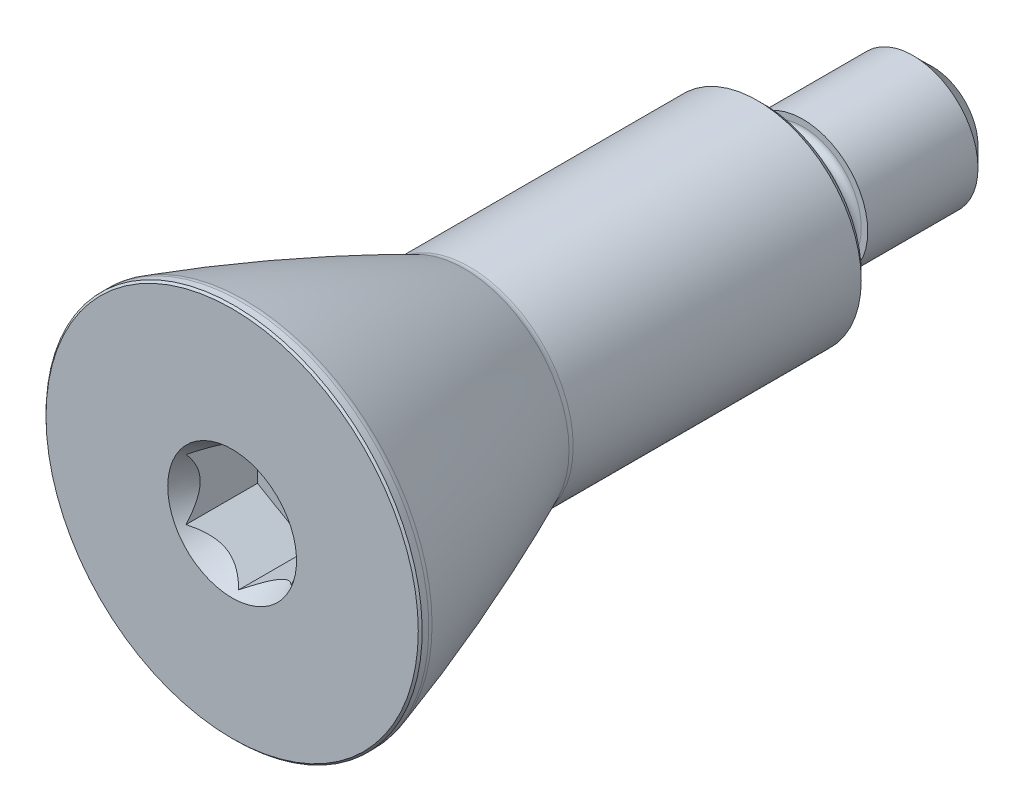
ISO-10303-21;
HEADER;
FILE_DESCRIPTION(('STEP AP214'),'2;1');
FILE_NAME('part.step','',(''),(''),'','','');
FILE_SCHEMA(('AUTOMOTIVE_DESIGN { 1 0 10303 214 1 1 1 1 }'));
ENDSEC;
DATA;
#1=APPLICATION_CONTEXT('core data for automotive mechanical design processes');
#2=APPLICATION_PROTOCOL_DEFINITION('international standard','automotive_design',2000,#1);
#3=PRODUCT_CONTEXT('',#1,'mechanical');
#4=PRODUCT('Part','Part','',(#3));
#5=PRODUCT_RELATED_PRODUCT_CATEGORY('part','',(#4));
#6=PRODUCT_DEFINITION_FORMATION('','',#4);
#7=PRODUCT_DEFINITION_CONTEXT('part definition',#1,'design');
#8=PRODUCT_DEFINITION('design','',#6,#7);
#9=PRODUCT_DEFINITION_SHAPE('','',#8);
#10=(LENGTH_UNIT() NAMED_UNIT(*) SI_UNIT(.MILLI.,.METRE.));
#11=(NAMED_UNIT(*) PLANE_ANGLE_UNIT() SI_UNIT($,.RADIAN.));
#12=(NAMED_UNIT(*) SI_UNIT($,.STERADIAN.) SOLID_ANGLE_UNIT());
#13=UNCERTAINTY_MEASURE_WITH_UNIT(LENGTH_MEASURE(1.E-05),#10,'distance_accuracy_value','');
#14=(GEOMETRIC_REPRESENTATION_CONTEXT(3) GLOBAL_UNCERTAINTY_ASSIGNED_CONTEXT((#13)) GLOBAL_UNIT_ASSIGNED_CONTEXT((#10,
#11,#12)) REPRESENTATION_CONTEXT('',''));
#15=CARTESIAN_POINT('',(0.,0.,0.));
#16=DIRECTION('',(0.,0.,1.));
#17=DIRECTION('',(1.,0.,0.));
#18=AXIS2_PLACEMENT_3D('',#15,#16,#17);
#19=CARTESIAN_POINT('',(0.,0.,41.));
#20=DIRECTION('',(0.,0.,-1.));
#21=DIRECTION('',(0.5,0.866025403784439,0.));
#22=AXIS2_PLACEMENT_3D('',#19,#20,#21);
#23=PLANE('',#22);
#24=CARTESIAN_POINT('',(0.,0.,41.));
#25=DIRECTION('',(0.,0.,-1.));
#26=DIRECTION('',(0.5,0.866025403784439,0.));
#27=AXIS2_PLACEMENT_3D('',#24,#25,#26);
#28=CIRCLE('',#27,14.35);
#29=CARTESIAN_POINT('',(7.175,12.4274645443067,41.));
#30=VERTEX_POINT('',#29);
#31=EDGE_CURVE('E22',#30,#30,#28,.F.);
#32=ORIENTED_EDGE('',*,*,#31,.T.);
#33=EDGE_LOOP('',(#32));
#34=FACE_BOUND('',#33,.T.);
#35=CARTESIAN_POINT('',(0.,0.,41.));
#36=DIRECTION('',(0.,0.,-1.));
#37=DIRECTION('',(0.5,0.866025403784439,0.));
#38=AXIS2_PLACEMENT_3D('',#35,#36,#37);
#39=CIRCLE('',#38,4.96521231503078);
#40=CARTESIAN_POINT('',(2.48260615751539,4.3,41.));
#41=VERTEX_POINT('',#40);
#42=EDGE_CURVE('E80',#41,#41,#39,.F.);
#43=ORIENTED_EDGE('',*,*,#42,.F.);
#44=EDGE_LOOP('',(#43));
#45=FACE_BOUND('',#44,.T.);
#46=ADVANCED_FACE('F14',(#34,#45),#23,.F.);
#47=CARTESIAN_POINT('',(0.,0.,-13.));
#48=DIRECTION('',(0.,0.,1.));
#49=DIRECTION('',(-0.5,-0.866025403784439,0.));
#50=AXIS2_PLACEMENT_3D('',#47,#48,#49);
#51=PLANE('',#50);
#52=CARTESIAN_POINT('',(0.,0.,-13.));
#53=DIRECTION('',(0.,0.,1.));
#54=DIRECTION('',(-0.5,-0.866025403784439,0.));
#55=AXIS2_PLACEMENT_3D('',#52,#53,#54);
#56=CIRCLE('',#55,3.5);
#57=CARTESIAN_POINT('',(-1.75,-3.03108891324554,-13.));
#58=VERTEX_POINT('',#57);
#59=EDGE_CURVE('E74',#58,#58,#56,.F.);
#60=ORIENTED_EDGE('',*,*,#59,.T.);
#61=EDGE_LOOP('',(#60));
#62=FACE_BOUND('',#61,.T.);
#63=ADVANCED_FACE('F204',(#62),#51,.F.);
#64=CARTESIAN_POINT('',(0.,0.,40.2674973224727));
#65=DIRECTION('',(0.,0.,1.));
#66=DIRECTION('',(-0.5,-0.866025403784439,0.));
#67=AXIS2_PLACEMENT_3D('',#64,#65,#66);
#68=CYLINDRICAL_SURFACE('',#67,5.);
#69=CARTESIAN_POINT('',(0.,0.,-11.5));
#70=DIRECTION('',(0.,0.,1.));
#71=DIRECTION('',(-0.5,-0.866025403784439,0.));
#72=AXIS2_PLACEMENT_3D('',#69,#70,#71);
#73=CIRCLE('',#72,5.);
#74=CARTESIAN_POINT('',(-2.5,-4.3301270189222,-11.5));
#75=VERTEX_POINT('',#74);
#76=EDGE_CURVE('E130',#75,#75,#73,.T.);
#77=ORIENTED_EDGE('',*,*,#76,.T.);
#78=EDGE_LOOP('',(#77));
#79=FACE_BOUND('',#78,.T.);
#80=CARTESIAN_POINT('',(0.,0.,-3.));
#81=DIRECTION('',(0.,0.,1.));
#82=DIRECTION('',(-0.5,-0.866025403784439,0.));
#83=AXIS2_PLACEMENT_3D('',#80,#81,#82);
#84=CIRCLE('',#83,5.);
#85=CARTESIAN_POINT('',(-2.5,-4.3301270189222,-3.));
#86=VERTEX_POINT('',#85);
#87=EDGE_CURVE('E121',#86,#86,#84,.T.);
#88=ORIENTED_EDGE('',*,*,#87,.F.);
#89=EDGE_LOOP('',(#88));
#90=FACE_BOUND('',#89,.T.);
#91=ADVANCED_FACE('F211',(#79,#90),#68,.T.);
#92=CARTESIAN_POINT('',(3.89711431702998,-2.25,-3.));
#93=DIRECTION('',(0.,0.,-1.));
#94=DIRECTION('',(0.5,0.866025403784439,0.));
#95=AXIS2_PLACEMENT_3D('',#92,#93,#94);
#96=PLANE('',#95);
#97=CARTESIAN_POINT('',(0.,0.,-3.));
#98=DIRECTION('',(0.,0.,1.));
#99=DIRECTION('',(-0.5,-0.866025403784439,0.));
#100=AXIS2_PLACEMENT_3D('',#97,#98,#99);
#101=CIRCLE('',#100,4.5);
#102=CARTESIAN_POINT('',(-2.25,-3.89711431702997,-3.));
#103=VERTEX_POINT('',#102);
#104=EDGE_CURVE('E118',#103,#103,#101,.T.);
#105=ORIENTED_EDGE('',*,*,#104,.F.);
#106=EDGE_LOOP('',(#105));
#107=FACE_BOUND('',#106,.T.);
#108=ORIENTED_EDGE('',*,*,#87,.T.);
#109=EDGE_LOOP('',(#108));
#110=FACE_BOUND('',#109,.T.);
#111=ADVANCED_FACE('F254',(#107,#110),#96,.F.);
#112=CARTESIAN_POINT('',(0.,0.,-2.5));
#113=DIRECTION('',(0.,0.,1.));
#114=DIRECTION('',(-0.5,-0.866025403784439,0.));
#115=AXIS2_PLACEMENT_3D('',#112,#113,#114);
#116=TOROIDAL_SURFACE('',#115,4.5,0.5);
#117=CARTESIAN_POINT('',(0.,0.,-2.5));
#118=DIRECTION('',(0.,0.,1.));
#119=DIRECTION('',(-0.5,-0.866025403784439,0.));
#120=AXIS2_PLACEMENT_3D('',#117,#118,#119);
#121=CIRCLE('',#120,4.);
#122=CARTESIAN_POINT('',(-2.,-3.46410161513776,-2.5));
#123=VERTEX_POINT('',#122);
#124=EDGE_CURVE('E115',#123,#123,#121,.T.);
#125=ORIENTED_EDGE('',*,*,#124,.F.);
#126=EDGE_LOOP('',(#125));
#127=FACE_BOUND('',#126,.T.);
#128=ORIENTED_EDGE('',*,*,#104,.T.);
#129=EDGE_LOOP('',(#128));
#130=FACE_BOUND('',#129,.T.);
#131=ADVANCED_FACE('F250',(#127,#130),#116,.F.);
#132=CARTESIAN_POINT('',(0.,0.,40.2674973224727));
#133=DIRECTION('',(0.,0.,1.));
#134=DIRECTION('',(-0.5,-0.866025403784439,0.));
#135=AXIS2_PLACEMENT_3D('',#132,#133,#134);
#136=CYLINDRICAL_SURFACE('',#135,4.);
#137=CARTESIAN_POINT('',(0.,0.,-0.5));
#138=DIRECTION('',(0.,0.,1.));
#139=DIRECTION('',(-0.5,-0.866025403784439,0.));
#140=AXIS2_PLACEMENT_3D('',#137,#138,#139);
#141=CIRCLE('',#140,4.);
#142=CARTESIAN_POINT('',(-2.,-3.46410161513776,-0.5));
#143=VERTEX_POINT('',#142);
#144=EDGE_CURVE('E112',#143,#143,#141,.T.);
#145=ORIENTED_EDGE('',*,*,#144,.F.);
#146=EDGE_LOOP('',(#145));
#147=FACE_BOUND('',#146,.T.);
#148=ORIENTED_EDGE('',*,*,#124,.T.);
#149=EDGE_LOOP('',(#148));
#150=FACE_BOUND('',#149,.T.);
#151=ADVANCED_FACE('F246',(#147,#150),#136,.T.);
#152=CARTESIAN_POINT('',(0.,0.,-0.5));
#153=DIRECTION('',(0.,0.,1.));
#154=DIRECTION('',(-0.5,-0.866025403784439,0.));
#155=AXIS2_PLACEMENT_3D('',#152,#153,#154);
#156=TOROIDAL_SURFACE('',#155,4.5,0.5);
#157=CARTESIAN_POINT('',(0.,0.,0.));
#158=DIRECTION('',(0.,0.,1.));
#159=DIRECTION('',(-0.5,-0.866025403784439,0.));
#160=AXIS2_PLACEMENT_3D('',#157,#158,#159);
#161=CIRCLE('',#160,4.5);
#162=CARTESIAN_POINT('',(-2.25,-3.89711431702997,0.));
#163=VERTEX_POINT('',#162);
#164=EDGE_CURVE('E109',#163,#163,#161,.T.);
#165=ORIENTED_EDGE('',*,*,#164,.F.);
#166=EDGE_LOOP('',(#165));
#167=FACE_BOUND('',#166,.T.);
#168=ORIENTED_EDGE('',*,*,#144,.T.);
#169=EDGE_LOOP('',(#168));
#170=FACE_BOUND('',#169,.T.);
#171=ADVANCED_FACE('F242',(#167,#170),#156,.F.);
#172=CARTESIAN_POINT('',(3.89711431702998,-2.25,0.));
#173=DIRECTION('',(0.,0.,1.));
#174=DIRECTION('',(-0.5,-0.866025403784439,0.));
#175=AXIS2_PLACEMENT_3D('',#172,#173,#174);
#176=PLANE('',#175);
#177=CARTESIAN_POINT('',(0.,0.,0.));
#178=DIRECTION('',(0.,0.,1.));
#179=DIRECTION('',(-0.5,-0.866025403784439,0.));
#180=AXIS2_PLACEMENT_3D('',#177,#178,#179);
#181=CIRCLE('',#180,7.5);
#182=CARTESIAN_POINT('',(-3.75,-6.49519052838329,0.));
#183=VERTEX_POINT('',#182);
#184=EDGE_CURVE('E127',#183,#183,#181,.F.);
#185=ORIENTED_EDGE('',*,*,#184,.T.);
#186=EDGE_LOOP('',(#185));
#187=FACE_BOUND('',#186,.T.);
#188=ORIENTED_EDGE('',*,*,#164,.T.);
#189=EDGE_LOOP('',(#188));
#190=FACE_BOUND('',#189,.T.);
#191=ADVANCED_FACE('F238',(#187,#190),#176,.F.);
#192=CARTESIAN_POINT('',(0.,0.,40.2674973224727));
#193=DIRECTION('',(0.,0.,1.));
#194=DIRECTION('',(-0.5,-0.866025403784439,0.));
#195=AXIS2_PLACEMENT_3D('',#192,#193,#194);
#196=CYLINDRICAL_SURFACE('',#195,8.);
#197=CARTESIAN_POINT('',(0.,0.,0.499999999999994));
#198=DIRECTION('',(0.,0.,1.));
#199=DIRECTION('',(-0.5,-0.866025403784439,0.));
#200=AXIS2_PLACEMENT_3D('',#197,#198,#199);
#201=CIRCLE('',#200,8.);
#202=CARTESIAN_POINT('',(-4.,-6.92820323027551,0.499999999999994));
#203=VERTEX_POINT('',#202);
#204=EDGE_CURVE('E124',#203,#203,#201,.T.);
#205=ORIENTED_EDGE('',*,*,#204,.T.);
#206=EDGE_LOOP('',(#205));
#207=FACE_BOUND('',#206,.T.);
#208=CARTESIAN_POINT('',(0.,0.,22.7070705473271));
#209=DIRECTION('',(0.,0.,1.));
#210=DIRECTION('',(-0.5,-0.866025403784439,0.));
#211=AXIS2_PLACEMENT_3D('',#208,#209,#210);
#212=CIRCLE('',#211,8.);
#213=CARTESIAN_POINT('',(-4.,-6.92820323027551,22.7070705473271));
#214=VERTEX_POINT('',#213);
#215=EDGE_CURVE('E106',#214,#214,#212,.T.);
#216=ORIENTED_EDGE('',*,*,#215,.F.);
#217=EDGE_LOOP('',(#216));
#218=FACE_BOUND('',#217,.T.);
#219=ADVANCED_FACE('F234',(#207,#218),#196,.T.);
#220=CARTESIAN_POINT('',(0.,0.,22.7070705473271));
#221=DIRECTION('',(0.,0.,1.));
#222=DIRECTION('',(-0.5,-0.866025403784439,0.));
#223=AXIS2_PLACEMENT_3D('',#220,#221,#222);
#224=TOROIDAL_SURFACE('',#223,9.,1.);
#225=CARTESIAN_POINT('',(0.,0.,23.1149907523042));
#226=DIRECTION('',(0.,0.,1.));
#227=DIRECTION('',(-0.5,-0.866025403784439,0.));
#228=AXIS2_PLACEMENT_3D('',#225,#226,#227);
#229=CIRCLE('',#228,8.08698241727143);
#230=CARTESIAN_POINT('',(-4.04349120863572,-7.00353221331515,23.1149907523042));
#231=VERTEX_POINT('',#230);
#232=EDGE_CURVE('E103',#231,#231,#229,.T.);
#233=ORIENTED_EDGE('',*,*,#232,.F.);
#234=EDGE_LOOP('',(#233));
#235=FACE_BOUND('',#234,.T.);
#236=ORIENTED_EDGE('',*,*,#215,.T.);
#237=EDGE_LOOP('',(#236));
#238=FACE_BOUND('',#237,.T.);
#239=ADVANCED_FACE('F230',(#235,#238),#224,.F.);
#240=CARTESIAN_POINT('',(0.,0.,84.3030214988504));
#241=DIRECTION('',(0.,0.,1.));
#242=DIRECTION('',(-0.5,-0.866025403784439,0.));
#243=AXIS2_PLACEMENT_3D('',#240,#241,#242);
#244=DEGENERATE_TOROIDAL_SURFACE('',#243,128.865654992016,150.,.F.);
#245=CARTESIAN_POINT('',(0.,0.,40.0418203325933));
#246=DIRECTION('',(0.,0.,1.));
#247=DIRECTION('',(-0.5,-0.866025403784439,0.));
#248=AXIS2_PLACEMENT_3D('',#245,#246,#247);
#249=CIRCLE('',#248,14.4554741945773);
#250=CARTESIAN_POINT('',(-7.22773709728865,-12.5188078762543,40.0418203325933));
#251=VERTEX_POINT('',#250);
#252=EDGE_CURVE('E100',#251,#251,#249,.T.);
#253=ORIENTED_EDGE('',*,*,#252,.F.);
#254=EDGE_LOOP('',(#253));
#255=FACE_BOUND('',#254,.T.);
#256=ORIENTED_EDGE('',*,*,#232,.T.);
#257=EDGE_LOOP('',(#256));
#258=FACE_BOUND('',#257,.T.);
#259=ADVANCED_FACE('F226',(#255,#258),#244,.F.);
#260=CARTESIAN_POINT('',(0.,0.,40.3368950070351));
#261=DIRECTION('',(0.,0.,1.));
#262=DIRECTION('',(-0.5,-0.866025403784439,0.));
#263=AXIS2_PLACEMENT_3D('',#260,#261,#262);
#264=TOROIDAL_SURFACE('',#263,13.5,1.);
#265=CARTESIAN_POINT('',(0.,0.,40.3368950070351));
#266=DIRECTION('',(0.,0.,1.));
#267=DIRECTION('',(-0.5,-0.866025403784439,0.));
#268=AXIS2_PLACEMENT_3D('',#265,#266,#267);
#269=CIRCLE('',#268,14.5);
#270=CARTESIAN_POINT('',(-7.25,-12.5573683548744,40.3368950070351));
#271=VERTEX_POINT('',#270);
#272=EDGE_CURVE('E97',#271,#271,#269,.T.);
#273=ORIENTED_EDGE('',*,*,#272,.F.);
#274=EDGE_LOOP('',(#273));
#275=FACE_BOUND('',#274,.T.);
#276=ORIENTED_EDGE('',*,*,#252,.T.);
#277=EDGE_LOOP('',(#276));
#278=FACE_BOUND('',#277,.T.);
#279=ADVANCED_FACE('F222',(#275,#278),#264,.T.);
#280=CARTESIAN_POINT('',(0.,0.,40.2674973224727));
#281=DIRECTION('',(0.,0.,1.));
#282=DIRECTION('',(-0.5,-0.866025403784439,0.));
#283=AXIS2_PLACEMENT_3D('',#280,#281,#282);
#284=CYLINDRICAL_SURFACE('',#283,14.5);
#285=CARTESIAN_POINT('',(0.,0.,40.85));
#286=DIRECTION('',(0.,0.,-1.));
#287=DIRECTION('',(0.5,0.866025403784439,0.));
#288=AXIS2_PLACEMENT_3D('',#285,#286,#287);
#289=CIRCLE('',#288,14.5);
#290=CARTESIAN_POINT('',(7.25,12.5573683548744,40.85));
#291=VERTEX_POINT('',#290);
#292=EDGE_CURVE('E9',#291,#291,#289,.T.);
#293=ORIENTED_EDGE('',*,*,#292,.T.);
#294=EDGE_LOOP('',(#293));
#295=FACE_BOUND('',#294,.T.);
#296=ORIENTED_EDGE('',*,*,#272,.T.);
#297=EDGE_LOOP('',(#296));
#298=FACE_BOUND('',#297,.T.);
#299=ADVANCED_FACE('F218',(#295,#298),#284,.T.);
#300=CARTESIAN_POINT('',(0.,0.,0.499999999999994));
#301=DIRECTION('',(0.,0.,1.));
#302=DIRECTION('',(-0.5,-0.866025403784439,0.));
#303=AXIS2_PLACEMENT_3D('',#300,#301,#302);
#304=CONICAL_SURFACE('',#303,8.,0.785398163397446);
#305=ORIENTED_EDGE('',*,*,#184,.F.);
#306=EDGE_LOOP('',(#305));
#307=FACE_BOUND('',#306,.T.);
#308=ORIENTED_EDGE('',*,*,#204,.F.);
#309=EDGE_LOOP('',(#308));
#310=FACE_BOUND('',#309,.T.);
#311=ADVANCED_FACE('F221',(#307,#310),#304,.T.);
#312=CARTESIAN_POINT('',(0.,0.,-11.5));
#313=DIRECTION('',(0.,0.,1.));
#314=DIRECTION('',(-0.5,-0.866025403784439,0.));
#315=AXIS2_PLACEMENT_3D('',#312,#313,#314);
#316=CONICAL_SURFACE('',#315,5.,0.785398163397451);
#317=ORIENTED_EDGE('',*,*,#59,.F.);
#318=EDGE_LOOP('',(#317));
#319=FACE_BOUND('',#318,.T.);
#320=ORIENTED_EDGE('',*,*,#76,.F.);
#321=EDGE_LOOP('',(#320));
#322=FACE_BOUND('',#321,.T.);
#323=ADVANCED_FACE('F147',(#319,#322),#316,.T.);
#324=CARTESIAN_POINT('',(0.,0.,32.4));
#325=DIRECTION('',(0.,0.,1.));
#326=DIRECTION('',(-0.5,-0.866025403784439,0.));
#327=AXIS2_PLACEMENT_3D('',#324,#325,#326);
#328=CONICAL_SURFACE('',#327,0.,0.523598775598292);
#329=CARTESIAN_POINT('',(4.05,2.33849953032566,40.5002000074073));
#330=CARTESIAN_POINT('',(4.05,2.28958686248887,40.4578415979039));
#331=CARTESIAN_POINT('',(4.05,2.24018615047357,40.4160481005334));
#332=CARTESIAN_POINT('',(4.05,2.1403012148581,40.3337484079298));
#333=CARTESIAN_POINT('',(4.05,2.08981668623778,40.2932425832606));
#334=CARTESIAN_POINT('',(4.05,1.9360983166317,40.1735237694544));
#335=CARTESIAN_POINT('',(4.05,1.83109601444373,40.0965444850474));
#336=CARTESIAN_POINT('',(4.05,1.61291732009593,39.9485748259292));
#337=CARTESIAN_POINT('',(4.05,1.49959982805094,39.877790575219));
#338=CARTESIAN_POINT('',(4.05,1.2668261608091,39.7475032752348));
#339=CARTESIAN_POINT('',(4.05,1.14738432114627,39.6879752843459));
#340=CARTESIAN_POINT('',(4.05,0.958076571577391,39.607544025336));
#341=CARTESIAN_POINT('',(4.05,0.890426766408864,39.5814023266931));
#342=CARTESIAN_POINT('',(4.05,0.753355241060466,39.5341856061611));
#343=CARTESIAN_POINT('',(4.05,0.683933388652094,39.5131109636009));
#344=CARTESIAN_POINT('',(4.05,0.544146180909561,39.4768339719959));
#345=CARTESIAN_POINT('',(4.05,0.473792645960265,39.461586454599));
#346=CARTESIAN_POINT('',(4.05,0.332026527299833,39.4372799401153));
#347=CARTESIAN_POINT('',(4.05,0.260614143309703,39.4282197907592));
#348=CARTESIAN_POINT('',(4.05,0.116593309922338,39.4165961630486));
#349=CARTESIAN_POINT('',(4.05,0.043979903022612,39.4140933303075));
#350=CARTESIAN_POINT('',(4.05,-0.101162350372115,39.4158678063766));
#351=CARTESIAN_POINT('',(4.05,-0.173691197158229,39.4201450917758));
#352=CARTESIAN_POINT('',(4.05,-0.318208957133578,39.4353128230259));
#353=CARTESIAN_POINT('',(4.05,-0.390196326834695,39.4462178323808));
#354=CARTESIAN_POINT('',(4.05,-0.532980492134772,39.4742200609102));
#355=CARTESIAN_POINT('',(4.05,-0.603776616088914,39.4913206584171));
#356=CARTESIAN_POINT('',(4.05,-0.763959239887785,39.5368527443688));
#357=CARTESIAN_POINT('',(4.05,-0.852820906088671,39.5671295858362));
#358=CARTESIAN_POINT('',(4.05,-1.02750557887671,39.6355397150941));
#359=CARTESIAN_POINT('',(4.05,-1.1133257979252,39.6736800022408));
#360=CARTESIAN_POINT('',(4.05,-1.28210255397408,39.7565705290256));
#361=CARTESIAN_POINT('',(4.05,-1.3650464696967,39.8013462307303));
#362=CARTESIAN_POINT('',(4.05,-1.52780712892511,39.8961638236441));
#363=CARTESIAN_POINT('',(4.05,-1.60762465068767,39.9462043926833));
#364=CARTESIAN_POINT('',(4.05,-1.80094607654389,40.0748865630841));
#365=CARTESIAN_POINT('',(4.05,-1.91281174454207,40.1559882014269));
#366=CARTESIAN_POINT('',(4.05,-2.07598953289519,40.2822414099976));
#367=CARTESIAN_POINT('',(4.05,-2.12932315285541,40.3248389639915));
#368=CARTESIAN_POINT('',(4.05,-2.23478443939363,40.4114813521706));
#369=CARTESIAN_POINT('',(4.05,-2.2869123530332,40.4555258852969));
#370=CARTESIAN_POINT('',(4.05,-2.33849953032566,40.5002000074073));
#371=B_SPLINE_CURVE_WITH_KNOTS('',3,(#329,#330,#331,#332,#333,#334,#335,#336,#337,#338,#339,
#340,#341,#342,#343,#344,#345,#346,#347,#348,#349,#350,#351,#352,#353,#354,#355,#356,#357,#358,
#359,#360,#361,#362,#363,#364,#365,#366,#367,#368,#369,#370),.UNSPECIFIED.,.F.,.F.,(4,2,2,2,2,2,
2,2,2,2,2,2,2,2,2,2,2,2,2,2,4),(0.,0.194104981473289,0.388265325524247,0.778563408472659,
1.17894566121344,1.57843007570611,1.79584069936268,2.01326759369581,2.22897318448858,
2.4446385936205,2.6622916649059,2.8799439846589,3.09807630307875,3.31632774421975,
3.59750191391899,3.87892744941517,4.16146228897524,4.44392634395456,4.85804110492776,
5.06279519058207,5.26750694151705),.UNSPECIFIED.);
#372=CARTESIAN_POINT('',(4.05000000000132,2.33826859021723,40.5000000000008));
#373=VERTEX_POINT('',#372);
#374=CARTESIAN_POINT('',(4.05,-2.33826859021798,40.5));
#375=VERTEX_POINT('',#374);
#376=EDGE_CURVE('E70',#373,#375,#371,.T.);
#377=ORIENTED_EDGE('',*,*,#376,.T.);
#378=CARTESIAN_POINT('',(4.0502,-2.33815312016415,40.5002000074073));
#379=CARTESIAN_POINT('',(4.00784038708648,-2.36260945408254,40.4578415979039));
#380=CARTESIAN_POINT('',(3.96505811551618,-2.38730981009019,40.4160481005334));
#381=CARTESIAN_POINT('',(3.87855522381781,-2.43725227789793,40.3337484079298));
#382=CARTESIAN_POINT('',(3.83483433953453,-2.46249454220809,40.2932425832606));
#383=CARTESIAN_POINT('',(3.70171032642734,-2.53935372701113,40.1735237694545));
#384=CARTESIAN_POINT('',(3.61077566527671,-2.59185487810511,40.0965444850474));
#385=CARTESIAN_POINT('',(3.421827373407,-2.70094422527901,39.9485748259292));
#386=CARTESIAN_POINT('',(3.32369154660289,-2.75760297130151,39.877790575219));
#387=CARTESIAN_POINT('',(3.12210363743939,-2.87398980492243,39.7475032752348));
#388=CARTESIAN_POINT('',(3.01866397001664,-2.93371072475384,39.6879752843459));
#389=CARTESIAN_POINT('',(2.85471864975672,-3.02836459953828,39.607544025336));
#390=CARTESIAN_POINT('',(2.79613219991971,-3.06218950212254,39.5814023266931));
#391=CARTESIAN_POINT('',(2.67742477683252,-3.13072526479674,39.5341856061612));
#392=CARTESIAN_POINT('',(2.61730368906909,-3.16543619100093,39.5131109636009));
#393=CARTESIAN_POINT('',(2.49624441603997,-3.23532979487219,39.4768339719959));
#394=CARTESIAN_POINT('',(2.43531646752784,-3.27050656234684,39.461586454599));
#395=CARTESIAN_POINT('',(2.31254340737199,-3.34138962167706,39.4372799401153));
#396=CARTESIAN_POINT('',(2.25069846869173,-3.37709581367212,39.4282197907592));
#397=CARTESIAN_POINT('',(2.12597276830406,-3.4491062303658,39.4165961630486));
#398=CARTESIAN_POINT('',(2.06308771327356,-3.48541293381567,39.4140933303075));
#399=CARTESIAN_POINT('',(1.93739083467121,-3.55798406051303,39.4158678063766));
#400=CARTESIAN_POINT('',(1.87457901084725,-3.59424848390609,39.4201450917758));
#401=CARTESIAN_POINT('',(1.74942295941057,-3.66650736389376,39.4353128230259));
#402=CARTESIAN_POINT('',(1.68708006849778,-3.70250104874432,39.4462178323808));
#403=CARTESIAN_POINT('',(1.56342535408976,-3.77389313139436,39.4742200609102));
#404=CARTESIAN_POINT('',(1.502114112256,-3.80929119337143,39.4913206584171));
#405=CARTESIAN_POINT('',(1.36339189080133,-3.88938250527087,39.5368527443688));
#406=CARTESIAN_POINT('',(1.28643543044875,-3.93381333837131,39.5671295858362));
#407=CARTESIAN_POINT('',(1.13515406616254,-4.02115567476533,39.6355397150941));
#408=CARTESIAN_POINT('',(1.0608315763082,-4.06406578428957,39.6736800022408));
#409=CARTESIAN_POINT('',(0.914666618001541,-4.14845416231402,39.7565705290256));
#410=CARTESIAN_POINT('',(0.842835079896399,-4.18992612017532,39.8013462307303));
#411=CARTESIAN_POINT('',(0.701880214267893,-4.27130644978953,39.8961638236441));
#412=CARTESIAN_POINT('',(0.632756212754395,-4.31121521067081,39.9462043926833));
#413=CARTESIAN_POINT('',(0.465334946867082,-4.40787592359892,40.0748865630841));
#414=CARTESIAN_POINT('',(0.368456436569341,-4.46380875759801,40.1559882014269));
#415=CARTESIAN_POINT('',(0.227140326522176,-4.54539765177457,40.2822414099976));
#416=CARTESIAN_POINT('',(0.180952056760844,-4.57206446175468,40.3248389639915));
#417=CARTESIAN_POINT('',(0.0896199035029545,-4.62479510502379,40.4114813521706));
#418=CARTESIAN_POINT('',(0.0444758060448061,-4.65085906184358,40.4555258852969));
#419=CARTESIAN_POINT('',(-0.000199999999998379,-4.67665265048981,40.5002000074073));
#420=B_SPLINE_CURVE_WITH_KNOTS('',3,(#378,#379,#380,#381,#382,#383,#384,#385,#386,#387,#388,
#389,#390,#391,#392,#393,#394,#395,#396,#397,#398,#399,#400,#401,#402,#403,#404,#405,#406,#407,
#408,#409,#410,#411,#412,#413,#414,#415,#416,#417,#418,#419),.UNSPECIFIED.,.F.,.F.,(4,2,2,2,2,2,
2,2,2,2,2,2,2,2,2,2,2,2,2,2,4),(0.,0.194104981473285,0.388265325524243,0.778563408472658,
1.17894566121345,1.57843007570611,1.79584069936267,2.01326759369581,2.22897318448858,
2.44463859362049,2.6622916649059,2.87994398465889,3.09807630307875,3.31632774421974,
3.59750191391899,3.87892744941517,4.16146228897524,4.44392634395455,4.85804110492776,
5.06279519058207,5.26750694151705),.UNSPECIFIED.);
#421=CARTESIAN_POINT('',(1.32055824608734E-12,-4.67653718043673,40.5000000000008));
#422=VERTEX_POINT('',#421);
#423=EDGE_CURVE('E81',#375,#422,#420,.T.);
#424=ORIENTED_EDGE('',*,*,#423,.T.);
#425=CARTESIAN_POINT('',(-10.4377574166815,1.3497048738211,50.6292470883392));
#426=CARTESIAN_POINT('',(-10.3167441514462,1.27983783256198,50.4058615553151));
#427=CARTESIAN_POINT('',(-10.1954564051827,1.20981231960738,50.1826743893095));
#428=CARTESIAN_POINT('',(-9.95224918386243,1.06939656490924,49.736757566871));
#429=CARTESIAN_POINT('',(-9.83032970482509,0.999006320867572,49.5140279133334));
#430=CARTESIAN_POINT('',(-9.46328212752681,0.787091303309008,48.8462209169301));
#431=CARTESIAN_POINT('',(-9.21708201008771,0.644947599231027,48.4019271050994));
#432=CARTESIAN_POINT('',(-8.71399648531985,0.354491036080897,47.5038170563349));
#433=CARTESIAN_POINT('',(-8.45700447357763,0.206116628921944,47.0500803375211));
#434=CARTESIAN_POINT('',(-7.93775817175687,-0.0936703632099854,46.1471494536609));
#435=CARTESIAN_POINT('',(-7.67550834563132,-0.245080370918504,45.6979518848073));
#436=CARTESIAN_POINT('',(-7.2763636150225,-0.475526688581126,45.0290917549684));
#437=CARTESIAN_POINT('',(-7.14242622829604,-0.552855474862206,44.807077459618));
#438=CARTESIAN_POINT('',(-6.87212789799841,-0.708912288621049,44.3650245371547));
#439=CARTESIAN_POINT('',(-6.73576697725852,-0.787640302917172,44.1449858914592));
#440=CARTESIAN_POINT('',(-6.45968908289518,-0.947033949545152,43.706857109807));
#441=CARTESIAN_POINT('',(-6.31996437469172,-1.02770404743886,43.4887734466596));
#442=CARTESIAN_POINT('',(-6.10752655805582,-1.15035507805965,43.1641665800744));
#443=CARTESIAN_POINT('',(-6.03624532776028,-1.19150931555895,43.0563935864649));
#444=CARTESIAN_POINT('',(-5.89258777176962,-1.27445004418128,42.8418064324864));
#445=CARTESIAN_POINT('',(-5.82021132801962,-1.31623660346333,42.7349923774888));
#446=CARTESIAN_POINT('',(-5.60296421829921,-1.44166428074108,42.4187584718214));
#447=CARTESIAN_POINT('',(-5.45630095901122,-1.52634035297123,42.2109711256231));
#448=CARTESIAN_POINT('',(-5.15667617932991,-1.69932880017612,41.80154239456));
#449=CARTESIAN_POINT('',(-5.00371594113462,-1.78764043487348,41.5998997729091));
#450=CARTESIAN_POINT('',(-4.76816152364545,-1.92363784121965,41.30463300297));
#451=CARTESIAN_POINT('',(-4.68878308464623,-1.96946700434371,41.2075902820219));
#452=CARTESIAN_POINT('',(-4.52752286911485,-2.06257063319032,41.0163262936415));
#453=CARTESIAN_POINT('',(-4.44564136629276,-2.10984494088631,40.9221047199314));
#454=CARTESIAN_POINT('',(-4.27901769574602,-2.20604516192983,40.7373065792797));
#455=CARTESIAN_POINT('',(-4.19427891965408,-2.25496911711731,40.6467259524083));
#456=CARTESIAN_POINT('',(-4.02133287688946,-2.35481956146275,40.4701146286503));
#457=CARTESIAN_POINT('',(-3.93312663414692,-2.40574545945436,40.3840826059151));
#458=CARTESIAN_POINT('',(-3.76983230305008,-2.50002348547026,40.2338025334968));
#459=CARTESIAN_POINT('',(-3.69545368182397,-2.54296600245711,40.1685307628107));
#460=CARTESIAN_POINT('',(-3.54360457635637,-2.63063612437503,40.0428406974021));
#461=CARTESIAN_POINT('',(-3.46613265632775,-2.67536455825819,39.9824246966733));
#462=CARTESIAN_POINT('',(-3.30816266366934,-2.7665685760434,39.8680616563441));
#463=CARTESIAN_POINT('',(-3.22768050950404,-2.8130349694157,39.8140855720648));
#464=CARTESIAN_POINT('',(-3.06317018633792,-2.90801504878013,39.7139708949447));
#465=CARTESIAN_POINT('',(-2.9791447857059,-2.9565271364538,39.6678263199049));
#466=CARTESIAN_POINT('',(-2.81098302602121,-3.05361537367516,39.5870044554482));
#467=CARTESIAN_POINT('',(-2.72698829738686,-3.10210975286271,39.5519391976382));
#468=CARTESIAN_POINT('',(-2.55598229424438,-3.20084011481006,39.4927393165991));
#469=CARTESIAN_POINT('',(-2.46896772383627,-3.2510780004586,39.4686170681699));
#470=CARTESIAN_POINT('',(-2.32010780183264,-3.33702231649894,39.4385464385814));
#471=CARTESIAN_POINT('',(-2.25875658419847,-3.37244345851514,39.4292898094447));
#472=CARTESIAN_POINT('',(-2.13556447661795,-3.44356845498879,39.4172125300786));
#473=CARTESIAN_POINT('',(-2.07372354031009,-3.47927233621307,39.4143924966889));
#474=CARTESIAN_POINT('',(-1.9501207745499,-3.5506344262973,39.4153165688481));
#475=CARTESIAN_POINT('',(-1.88835891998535,-3.5862926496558,39.4190561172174));
#476=CARTESIAN_POINT('',(-1.76536578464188,-3.65730276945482,39.4329236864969));
#477=CARTESIAN_POINT('',(-1.7041347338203,-3.69265453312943,39.4430543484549));
#478=CARTESIAN_POINT('',(-1.52280622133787,-3.79734459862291,39.4823050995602));
#479=CARTESIAN_POINT('',(-1.40410356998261,-3.86587760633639,39.5203012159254));
#480=CARTESIAN_POINT('',(-1.1726884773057,-3.99948517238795,39.6153663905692));
#481=CARTESIAN_POINT('',(-1.05998337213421,-4.06455549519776,39.672458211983));
#482=CARTESIAN_POINT('',(-0.842527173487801,-4.19010389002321,39.7998570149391));
#483=CARTESIAN_POINT('',(-0.737683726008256,-4.2506352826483,39.8699580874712));
#484=CARTESIAN_POINT('',(-0.533552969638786,-4.36849022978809,40.0203070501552));
#485=CARTESIAN_POINT('',(-0.43427134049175,-4.42581050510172,40.1005650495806));
#486=CARTESIAN_POINT('',(-0.239567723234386,-4.53822269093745,40.2694011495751));
#487=CARTESIAN_POINT('',(-0.144197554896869,-4.59328468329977,40.3580581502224));
#488=CARTESIAN_POINT('',(-0.00433259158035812,-4.67403575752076,40.4952653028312));
#489=CARTESIAN_POINT('',(0.0417467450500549,-4.70063967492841,40.5416930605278));
#490=CARTESIAN_POINT('',(0.132942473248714,-4.75329155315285,40.635791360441));
#491=CARTESIAN_POINT('',(0.178058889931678,-4.77933952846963,40.6834618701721));
#492=CARTESIAN_POINT('',(0.32176381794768,-4.86230760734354,40.8385328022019));
#493=CARTESIAN_POINT('',(0.418639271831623,-4.9182386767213,40.9480530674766));
#494=CARTESIAN_POINT('',(0.608858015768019,-5.0280615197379,41.1711245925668));
#495=CARTESIAN_POINT('',(0.702200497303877,-5.08195282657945,41.2846767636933));
#496=CARTESIAN_POINT('',(0.886013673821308,-5.18807741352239,41.5149853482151));
#497=CARTESIAN_POINT('',(0.976482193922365,-5.24030943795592,41.6317440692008));
#498=CARTESIAN_POINT('',(1.15496041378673,-5.3433538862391,41.8677460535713));
#499=CARTESIAN_POINT('',(1.24296993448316,-5.39416620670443,41.986989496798));
#500=CARTESIAN_POINT('',(1.50460493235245,-5.54522124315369,42.3486627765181));
#501=CARTESIAN_POINT('',(1.67510688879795,-5.64366059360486,42.5941041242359));
#502=CARTESIAN_POINT('',(2.00999401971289,-5.83700776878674,43.0902714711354));
#503=CARTESIAN_POINT('',(2.17438173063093,-5.93191705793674,43.3409952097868));
#504=CARTESIAN_POINT('',(2.48289829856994,-6.11003918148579,43.8218422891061));
#505=CARTESIAN_POINT('',(2.62744675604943,-6.19349427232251,44.051607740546));
#506=CARTESIAN_POINT('',(2.91362372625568,-6.35871862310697,44.5135880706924));
#507=CARTESIAN_POINT('',(3.05525187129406,-6.4404876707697,44.7458032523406));
#508=CARTESIAN_POINT('',(3.33492707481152,-6.60195822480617,45.210097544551));
#509=CARTESIAN_POINT('',(3.4729945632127,-6.68167152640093,45.4421602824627));
#510=CARTESIAN_POINT('',(3.7471829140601,-6.83997424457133,45.907747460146));
#511=CARTESIAN_POINT('',(3.8833041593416,-6.91856388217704,46.1412715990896));
#512=CARTESIAN_POINT('',(4.01866591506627,-6.99671502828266,46.3753744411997));
#513=B_SPLINE_CURVE_WITH_KNOTS('',3,(#425,#426,#427,#428,#429,#430,#431,#432,#433,#434,#435,
#436,#437,#438,#439,#440,#441,#442,#443,#444,#445,#446,#447,#448,#449,#450,#451,#452,#453,#454,
#455,#456,#457,#458,#459,#460,#461,#462,#463,#464,#465,#466,#467,#468,#469,#470,#471,#472,#473,
#474,#475,#476,#477,#478,#479,#480,#481,#482,#483,#484,#485,#486,#487,#488,#489,#490,#491,#492,
#493,#494,#495,#496,#497,#498,#499,#500,#501,#502,#503,#504,#505,#506,#507,#508,#509,#510,#511,
#512),.UNSPECIFIED.,.F.,.F.,(4,2,2,2,2,2,2,2,2,2,2,2,2,2,2,2,2,2,2,2,2,2,2,2,2,2,2,2,2,2,2,2,2,
2,2,2,2,2,2,2,2,2,2,4),(0.,0.790467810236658,1.58094060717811,3.16330638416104,4.78975282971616,
6.41487243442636,7.2265721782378,8.03826427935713,8.85204554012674,9.25886342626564,
9.66572548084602,10.4697895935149,11.2736907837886,11.674102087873,12.0744697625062,
12.4743778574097,12.8741687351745,13.1976543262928,13.5212918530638,13.8434096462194,
14.1652802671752,14.4741470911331,14.7833623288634,14.9974295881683,15.2115173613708,
15.4254564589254,15.6394840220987,16.0642258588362,16.4894758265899,16.9084943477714,
17.3279332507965,17.7518007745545,17.9636335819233,18.1754608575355,18.6449584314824,
19.1145628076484,19.5845144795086,20.0545002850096,20.9982374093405,21.9415785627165,
22.7935143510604,23.6455567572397,24.4901907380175,25.3346562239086),.UNSPECIFIED.);
#514=CARTESIAN_POINT('',(-4.05,-2.33826859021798,40.5));
#515=VERTEX_POINT('',#514);
#516=EDGE_CURVE('E167',#422,#515,#513,.F.);
#517=ORIENTED_EDGE('',*,*,#516,.T.);
#518=CARTESIAN_POINT('',(-4.05,-2.33849953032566,40.5002000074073));
#519=CARTESIAN_POINT('',(-4.05,-2.28958686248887,40.4578415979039));
#520=CARTESIAN_POINT('',(-4.05,-2.24018615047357,40.4160481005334));
#521=CARTESIAN_POINT('',(-4.05,-2.1403012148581,40.3337484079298));
#522=CARTESIAN_POINT('',(-4.05,-2.08981668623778,40.2932425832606));
#523=CARTESIAN_POINT('',(-4.05,-1.9360983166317,40.1735237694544));
#524=CARTESIAN_POINT('',(-4.05,-1.83109601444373,40.0965444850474));
#525=CARTESIAN_POINT('',(-4.05,-1.61291732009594,39.9485748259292));
#526=CARTESIAN_POINT('',(-4.05,-1.49959982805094,39.877790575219));
#527=CARTESIAN_POINT('',(-4.05,-1.2668261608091,39.7475032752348));
#528=CARTESIAN_POINT('',(-4.05,-1.14738432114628,39.6879752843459));
#529=CARTESIAN_POINT('',(-4.05,-0.958076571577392,39.607544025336));
#530=CARTESIAN_POINT('',(-4.05,-0.890426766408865,39.5814023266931));
#531=CARTESIAN_POINT('',(-4.05,-0.753355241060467,39.5341856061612));
#532=CARTESIAN_POINT('',(-4.05,-0.683933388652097,39.5131109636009));
#533=CARTESIAN_POINT('',(-4.05,-0.544146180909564,39.4768339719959));
#534=CARTESIAN_POINT('',(-4.05,-0.473792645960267,39.461586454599));
#535=CARTESIAN_POINT('',(-4.05,-0.332026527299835,39.4372799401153));
#536=CARTESIAN_POINT('',(-4.05,-0.260614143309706,39.4282197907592));
#537=CARTESIAN_POINT('',(-4.05,-0.116593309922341,39.4165961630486));
#538=CARTESIAN_POINT('',(-4.05,-0.043979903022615,39.4140933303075));
#539=CARTESIAN_POINT('',(-4.05,0.101162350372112,39.4158678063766));
#540=CARTESIAN_POINT('',(-4.05,0.173691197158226,39.4201450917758));
#541=CARTESIAN_POINT('',(-4.05,0.318208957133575,39.4353128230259));
#542=CARTESIAN_POINT('',(-4.05,0.390196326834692,39.4462178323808));
#543=CARTESIAN_POINT('',(-4.05,0.532980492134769,39.4742200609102));
#544=CARTESIAN_POINT('',(-4.05,0.603776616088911,39.4913206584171));
#545=CARTESIAN_POINT('',(-4.05,0.763959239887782,39.5368527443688));
#546=CARTESIAN_POINT('',(-4.05,0.852820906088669,39.5671295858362));
#547=CARTESIAN_POINT('',(-4.05,1.02750557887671,39.6355397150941));
#548=CARTESIAN_POINT('',(-4.05,1.11332579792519,39.6736800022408));
#549=CARTESIAN_POINT('',(-4.05,1.28210255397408,39.7565705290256));
#550=CARTESIAN_POINT('',(-4.05,1.36504646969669,39.8013462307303));
#551=CARTESIAN_POINT('',(-4.05,1.5278071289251,39.8961638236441));
#552=CARTESIAN_POINT('',(-4.05,1.60762465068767,39.9462043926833));
#553=CARTESIAN_POINT('',(-4.05,1.80094607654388,40.0748865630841));
#554=CARTESIAN_POINT('',(-4.05,1.91281174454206,40.1559882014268));
#555=CARTESIAN_POINT('',(-4.05,2.07598953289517,40.2822414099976));
#556=CARTESIAN_POINT('',(-4.05,2.12932315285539,40.3248389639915));
#557=CARTESIAN_POINT('',(-4.05,2.23478443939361,40.4114813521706));
#558=CARTESIAN_POINT('',(-4.05,2.28691235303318,40.4555258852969));
#559=CARTESIAN_POINT('',(-4.05,2.33849953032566,40.5002000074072));
#560=B_SPLINE_CURVE_WITH_KNOTS('',3,(#518,#519,#520,#521,#522,#523,#524,#525,#526,#527,#528,
#529,#530,#531,#532,#533,#534,#535,#536,#537,#538,#539,#540,#541,#542,#543,#544,#545,#546,#547,
#548,#549,#550,#551,#552,#553,#554,#555,#556,#557,#558,#559),.UNSPECIFIED.,.F.,.F.,(4,2,2,2,2,2,
2,2,2,2,2,2,2,2,2,2,2,2,2,2,4),(0.,0.19410498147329,0.388265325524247,0.778563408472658,
1.17894566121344,1.57843007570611,1.79584069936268,2.01326759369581,2.22897318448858,
2.4446385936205,2.6622916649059,2.87994398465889,3.09807630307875,3.31632774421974,
3.59750191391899,3.87892744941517,4.16146228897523,4.44392634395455,4.85804110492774,
5.06279519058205,5.26750694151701),.UNSPECIFIED.);
#561=CARTESIAN_POINT('',(-4.05,2.33826859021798,40.5));
#562=VERTEX_POINT('',#561);
#563=EDGE_CURVE('E160',#515,#562,#560,.T.);
#564=ORIENTED_EDGE('',*,*,#563,.T.);
#565=CARTESIAN_POINT('',(-4.0502,2.33815312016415,40.5002000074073));
#566=CARTESIAN_POINT('',(-4.00784038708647,2.36260945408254,40.4578415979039));
#567=CARTESIAN_POINT('',(-3.96505811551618,2.38730981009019,40.4160481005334));
#568=CARTESIAN_POINT('',(-3.87855522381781,2.43725227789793,40.3337484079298));
#569=CARTESIAN_POINT('',(-3.83483433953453,2.46249454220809,40.2932425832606));
#570=CARTESIAN_POINT('',(-3.70171032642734,2.53935372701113,40.1735237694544));
#571=CARTESIAN_POINT('',(-3.61077566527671,2.59185487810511,40.0965444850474));
#572=CARTESIAN_POINT('',(-3.421827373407,2.70094422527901,39.9485748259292));
#573=CARTESIAN_POINT('',(-3.32369154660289,2.7576029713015,39.877790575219));
#574=CARTESIAN_POINT('',(-3.12210363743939,2.87398980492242,39.7475032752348));
#575=CARTESIAN_POINT('',(-3.01866397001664,2.93371072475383,39.6879752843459));
#576=CARTESIAN_POINT('',(-2.85471864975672,3.02836459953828,39.607544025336));
#577=CARTESIAN_POINT('',(-2.79613219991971,3.06218950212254,39.5814023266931));
#578=CARTESIAN_POINT('',(-2.67742477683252,3.13072526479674,39.5341856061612));
#579=CARTESIAN_POINT('',(-2.61730368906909,3.16543619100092,39.5131109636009));
#580=CARTESIAN_POINT('',(-2.49624441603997,3.23532979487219,39.4768339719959));
#581=CARTESIAN_POINT('',(-2.43531646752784,3.27050656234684,39.461586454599));
#582=CARTESIAN_POINT('',(-2.31254340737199,3.34138962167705,39.4372799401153));
#583=CARTESIAN_POINT('',(-2.25069846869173,3.37709581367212,39.4282197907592));
#584=CARTESIAN_POINT('',(-2.12597276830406,3.4491062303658,39.4165961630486));
#585=CARTESIAN_POINT('',(-2.06308771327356,3.48541293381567,39.4140933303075));
#586=CARTESIAN_POINT('',(-1.93739083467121,3.55798406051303,39.4158678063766));
#587=CARTESIAN_POINT('',(-1.87457901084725,3.59424848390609,39.4201450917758));
#588=CARTESIAN_POINT('',(-1.74942295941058,3.66650736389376,39.4353128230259));
#589=CARTESIAN_POINT('',(-1.68708006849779,3.70250104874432,39.4462178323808));
#590=CARTESIAN_POINT('',(-1.56342535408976,3.77389313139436,39.4742200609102));
#591=CARTESIAN_POINT('',(-1.502114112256,3.80929119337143,39.4913206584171));
#592=CARTESIAN_POINT('',(-1.36339189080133,3.88938250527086,39.5368527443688));
#593=CARTESIAN_POINT('',(-1.28643543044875,3.93381333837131,39.5671295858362));
#594=CARTESIAN_POINT('',(-1.13515406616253,4.02115567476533,39.6355397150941));
#595=CARTESIAN_POINT('',(-1.0608315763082,4.06406578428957,39.6736800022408));
#596=CARTESIAN_POINT('',(-0.91466661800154,4.14845416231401,39.7565705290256));
#597=CARTESIAN_POINT('',(-0.842835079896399,4.18992612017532,39.8013462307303));
#598=CARTESIAN_POINT('',(-0.701880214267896,4.27130644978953,39.8961638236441));
#599=CARTESIAN_POINT('',(-0.632756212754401,4.31121521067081,39.9462043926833));
#600=CARTESIAN_POINT('',(-0.465334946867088,4.40787592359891,40.0748865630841));
#601=CARTESIAN_POINT('',(-0.368456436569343,4.46380875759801,40.1559882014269));
#602=CARTESIAN_POINT('',(-0.227140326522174,4.54539765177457,40.2822414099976));
#603=CARTESIAN_POINT('',(-0.180952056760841,4.57206446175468,40.3248389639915));
#604=CARTESIAN_POINT('',(-0.0896199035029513,4.62479510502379,40.4114813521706));
#605=CARTESIAN_POINT('',(-0.0444758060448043,4.65085906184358,40.4555258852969));
#606=CARTESIAN_POINT('',(0.000200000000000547,4.67665265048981,40.5002000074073));
#607=B_SPLINE_CURVE_WITH_KNOTS('',3,(#565,#566,#567,#568,#569,#570,#571,#572,#573,#574,#575,
#576,#577,#578,#579,#580,#581,#582,#583,#584,#585,#586,#587,#588,#589,#590,#591,#592,#593,#594,
#595,#596,#597,#598,#599,#600,#601,#602,#603,#604,#605,#606),.UNSPECIFIED.,.F.,.F.,(4,2,2,2,2,2,
2,2,2,2,2,2,2,2,2,2,2,2,2,2,4),(0.,0.194104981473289,0.388265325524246,0.778563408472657,
1.17894566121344,1.57843007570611,1.79584069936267,2.01326759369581,2.22897318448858,
2.44463859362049,2.6622916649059,2.87994398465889,3.09807630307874,3.31632774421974,
3.59750191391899,3.87892744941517,4.16146228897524,4.44392634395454,4.85804110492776,
5.06279519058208,5.26750694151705),.UNSPECIFIED.);
#608=CARTESIAN_POINT('',(0.,4.67653718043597,40.5));
#609=VERTEX_POINT('',#608);
#610=EDGE_CURVE('E29',#562,#609,#607,.T.);
#611=ORIENTED_EDGE('',*,*,#610,.T.);
#612=CARTESIAN_POINT('',(-6.38775741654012,8.36451064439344,50.6292470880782));
#613=CARTESIAN_POINT('',(-6.26674415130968,8.29464360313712,50.4058615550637));
#614=CARTESIAN_POINT('',(-6.14545640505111,8.22461809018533,50.1826743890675));
#615=CARTESIAN_POINT('',(-5.90224918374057,8.08420233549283,49.7367575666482));
#616=CARTESIAN_POINT('',(-5.78032970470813,8.013812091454,49.5140279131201));
#617=CARTESIAN_POINT('',(-5.41328212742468,7.801897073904,48.8462209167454));
#618=CARTESIAN_POINT('',(-5.16708200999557,7.65975336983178,48.4019271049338));
#619=CARTESIAN_POINT('',(-4.66399648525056,7.36929680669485,47.5038170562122));
#620=CARTESIAN_POINT('',(-4.40700447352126,7.22092239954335,47.0500803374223));
#621=CARTESIAN_POINT('',(-3.88775817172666,6.92113540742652,46.1471494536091));
#622=CARTESIAN_POINT('',(-3.62550834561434,6.76972539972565,45.6979518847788));
#623=CARTESIAN_POINT('',(-3.22636361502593,6.5392790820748,45.0290917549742));
#624=CARTESIAN_POINT('',(-3.09242622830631,6.46195029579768,44.807077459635));
#625=CARTESIAN_POINT('',(-2.82212789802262,6.30589348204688,44.365024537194));
#626=CARTESIAN_POINT('',(-2.68576697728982,6.22716546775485,44.1449858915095));
#627=CARTESIAN_POINT('',(-2.40968908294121,6.06777182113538,43.7068571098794));
#628=CARTESIAN_POINT('',(-2.26996437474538,5.98710172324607,43.4887734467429));
#629=CARTESIAN_POINT('',(-2.05752655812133,5.86445069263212,43.1641665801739));
#630=CARTESIAN_POINT('',(-1.98624532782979,5.82329645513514,43.0563935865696));
#631=CARTESIAN_POINT('',(-1.84258777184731,5.74035572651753,42.8418064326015));
#632=CARTESIAN_POINT('',(-1.77021132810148,5.69856916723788,42.7349923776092));
#633=CARTESIAN_POINT('',(-1.55296421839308,5.57314148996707,42.4187584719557));
#634=CARTESIAN_POINT('',(-1.40630095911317,5.48846541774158,42.2109711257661));
#635=CARTESIAN_POINT('',(-1.10667617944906,5.31547697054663,41.8015423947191));
#636=CARTESIAN_POINT('',(-0.953715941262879,5.22716533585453,41.5998997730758));
#637=CARTESIAN_POINT('',(-0.718161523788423,5.09116792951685,41.3046330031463));
#638=CARTESIAN_POINT('',(-0.6387830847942,5.04533876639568,41.2075902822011));
#639=CARTESIAN_POINT('',(-0.477522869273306,4.95223513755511,41.0163262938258));
#640=CARTESIAN_POINT('',(-0.395641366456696,4.90496082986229,40.9221047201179));
#641=CARTESIAN_POINT('',(-0.22901769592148,4.80876060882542,40.7373065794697));
#642=CARTESIAN_POINT('',(-0.144278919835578,4.75983665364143,40.6467259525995));
#643=CARTESIAN_POINT('',(0.0286671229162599,4.65998620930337,40.4701146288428));
#644=CARTESIAN_POINT('',(0.116873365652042,4.60906031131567,40.3840826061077));
#645=CARTESIAN_POINT('',(0.280167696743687,4.51478228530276,40.2338025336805));
#646=CARTESIAN_POINT('',(0.354546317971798,4.47183976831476,40.1685307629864));
#647=CARTESIAN_POINT('',(0.506395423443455,4.38416964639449,40.0428406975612));
#648=CARTESIAN_POINT('',(0.583867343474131,4.33944121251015,39.9824246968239));
#649=CARTESIAN_POINT('',(0.741837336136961,4.24823719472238,39.8680616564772));
#650=CARTESIAN_POINT('',(0.822319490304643,4.20177080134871,39.8140855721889));
#651=CARTESIAN_POINT('',(0.986829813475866,4.10679072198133,39.7139708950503));
#652=CARTESIAN_POINT('',(1.07085521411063,4.05827863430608,39.6678263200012));
#653=CARTESIAN_POINT('',(1.23901697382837,3.96119039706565,39.5870044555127));
#654=CARTESIAN_POINT('',(1.32301170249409,3.91269601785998,39.5519391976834));
#655=CARTESIAN_POINT('',(1.49401770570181,3.81396565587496,39.4927393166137));
#656=CARTESIAN_POINT('',(1.58103227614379,3.76372777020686,39.4686170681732));
#657=CARTESIAN_POINT('',(1.72989219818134,3.67778345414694,39.4385464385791));
#658=CARTESIAN_POINT('',(1.79124341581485,3.64236231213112,39.429289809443));
#659=CARTESIAN_POINT('',(1.91443552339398,3.57123731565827,39.4172125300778));
#660=CARTESIAN_POINT('',(1.97627645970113,3.5355334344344,39.4143924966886));
#661=CARTESIAN_POINT('',(2.09987922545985,3.46417134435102,39.4153165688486));
#662=CARTESIAN_POINT('',(2.16164108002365,3.42851312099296,39.4190561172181));
#663=CARTESIAN_POINT('',(2.2846342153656,3.35750300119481,39.432923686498));
#664=CARTESIAN_POINT('',(2.34586526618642,3.32215123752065,39.4430543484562));
#665=CARTESIAN_POINT('',(2.52719377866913,3.217461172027,39.4823050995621));
#666=CARTESIAN_POINT('',(2.64589643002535,3.14892816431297,39.5203012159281));
#667=CARTESIAN_POINT('',(2.87731152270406,3.01532059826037,39.6153663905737));
#668=CARTESIAN_POINT('',(2.99001662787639,2.95025027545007,39.6724582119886));
#669=CARTESIAN_POINT('',(3.20747282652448,2.82470188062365,39.7998570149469));
#670=CARTESIAN_POINT('',(3.31231627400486,2.76417048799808,39.8699580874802));
#671=CARTESIAN_POINT('',(3.51644703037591,2.64631554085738,40.0203070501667));
#672=CARTESIAN_POINT('',(3.61572865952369,2.58899526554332,40.1005650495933));
#673=CARTESIAN_POINT('',(3.81043227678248,2.47658307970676,40.2694011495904));
#674=CARTESIAN_POINT('',(3.90580244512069,2.42152108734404,40.358058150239));
#675=CARTESIAN_POINT('',(4.0456674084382,2.34077001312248,40.4952653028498));
#676=CARTESIAN_POINT('',(4.09174674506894,2.31416609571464,40.541693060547));
#677=CARTESIAN_POINT('',(4.18294247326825,2.26151421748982,40.6357913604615));
#678=CARTESIAN_POINT('',(4.22805888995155,2.23546624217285,40.6834618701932));
#679=CARTESIAN_POINT('',(4.37176381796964,2.15249816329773,40.8385328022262));
#680=CARTESIAN_POINT('',(4.46863927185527,2.096567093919,40.9480530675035));
#681=CARTESIAN_POINT('',(4.65885801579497,1.9867442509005,41.1711245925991));
#682=CARTESIAN_POINT('',(4.75220049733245,1.93285294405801,41.2846767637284));
#683=CARTESIAN_POINT('',(4.93601367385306,1.82672835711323,41.5149853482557));
#684=CARTESIAN_POINT('',(5.02648219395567,1.7744963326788,41.6317440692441));
#685=CARTESIAN_POINT('',(5.20496041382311,1.67145188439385,41.8677460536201));
#686=CARTESIAN_POINT('',(5.29296993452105,1.62063956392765,41.9869894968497));
#687=CARTESIAN_POINT('',(5.55460493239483,1.46958452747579,42.3486627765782));
#688=CARTESIAN_POINT('',(5.72510688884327,1.37114517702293,42.5941041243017));
#689=CARTESIAN_POINT('',(6.05999401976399,1.1777980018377,43.0902714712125));
#690=CARTESIAN_POINT('',(6.22438173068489,1.08288871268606,43.3409952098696));
#691=CARTESIAN_POINT('',(6.53289829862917,0.904766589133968,43.8218422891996));
#692=CARTESIAN_POINT('',(6.67744675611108,0.821311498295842,44.0516077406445));
#693=CARTESIAN_POINT('',(6.96362372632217,0.656087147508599,44.5135880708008));
#694=CARTESIAN_POINT('',(7.10525187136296,0.574318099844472,44.745803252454));
#695=CARTESIAN_POINT('',(7.38492707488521,0.412847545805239,45.2100975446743));
#696=CARTESIAN_POINT('',(7.52299456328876,0.333134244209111,45.4421602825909));
#697=CARTESIAN_POINT('',(7.79718291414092,0.17483152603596,45.9077474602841));
#698=CARTESIAN_POINT('',(7.93330415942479,0.0962418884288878,46.1412715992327));
#699=CARTESIAN_POINT('',(8.06866591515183,0.0180907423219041,46.3753744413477));
#700=B_SPLINE_CURVE_WITH_KNOTS('',3,(#612,#613,#614,#615,#616,#617,#618,#619,#620,#621,#622,
#623,#624,#625,#626,#627,#628,#629,#630,#631,#632,#633,#634,#635,#636,#637,#638,#639,#640,#641,
#642,#643,#644,#645,#646,#647,#648,#649,#650,#651,#652,#653,#654,#655,#656,#657,#658,#659,#660,
#661,#662,#663,#664,#665,#666,#667,#668,#669,#670,#671,#672,#673,#674,#675,#676,#677,#678,#679,
#680,#681,#682,#683,#684,#685,#686,#687,#688,#689,#690,#691,#692,#693,#694,#695,#696,#697,#698,
#699),.UNSPECIFIED.,.F.,.F.,(4,2,2,2,2,2,2,2,2,2,2,2,2,2,2,2,2,2,2,2,2,2,2,2,2,2,2,2,2,2,2,2,2,
2,2,2,2,2,2,2,2,2,2,4),(0.,0.790467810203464,1.58094060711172,3.16330638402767,4.78975282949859,
6.41487243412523,7.22657217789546,8.03826427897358,8.85204553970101,9.25886342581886,
9.66572548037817,10.4697895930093,11.2736907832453,11.6741020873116,12.0744697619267,
12.4743778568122,12.8741687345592,13.1976543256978,13.521291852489,13.8434096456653,
14.1652802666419,14.4741470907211,14.7833623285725,14.9974295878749,15.2115173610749,
15.4254564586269,15.6394840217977,16.064225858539,16.4894758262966,16.9084943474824,
17.3279332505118,17.751800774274,17.9636335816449,18.1754608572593,18.6449584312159,
19.1145628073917,19.5845144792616,20.0545002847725,20.998237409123,21.9415785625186,
22.7935143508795,23.6455567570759,24.4901907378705,25.3346562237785),.UNSPECIFIED.);
#701=EDGE_CURVE('E66',#609,#373,#700,.T.);
#702=ORIENTED_EDGE('',*,*,#701,.T.);
#703=EDGE_LOOP('',(#377,#424,#517,#564,#611,#702));
#704=FACE_BOUND('',#703,.T.);
#705=ORIENTED_EDGE('',*,*,#42,.T.);
#706=EDGE_LOOP('',(#705));
#707=FACE_BOUND('',#706,.T.);
#708=ADVANCED_FACE('F68',(#704,#707),#328,.F.);
#709=CARTESIAN_POINT('',(4.05,2.33826859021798,35.));
#710=DIRECTION('',(0.,0.,1.));
#711=DIRECTION('',(-0.5,-0.866025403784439,0.));
#712=AXIS2_PLACEMENT_3D('',#709,#710,#711);
#713=PLANE('',#712);
#714=DIRECTION('',(0.,1.,0.));
#715=VECTOR('',#714,1.);
#716=CARTESIAN_POINT('',(4.05,-2.33826859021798,35.));
#717=LINE('',#716,#715);
#718=CARTESIAN_POINT('',(4.05,-2.33826859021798,35.));
#719=VERTEX_POINT('',#718);
#720=CARTESIAN_POINT('',(4.05,2.33826859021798,35.));
#721=VERTEX_POINT('',#720);
#722=EDGE_CURVE('E434',#719,#721,#717,.T.);
#723=ORIENTED_EDGE('',*,*,#722,.T.);
#724=DIRECTION('',(-0.866025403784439,0.5,0.));
#725=VECTOR('',#724,1.);
#726=CARTESIAN_POINT('',(4.05,2.33826859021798,35.));
#727=LINE('',#726,#725);
#728=CARTESIAN_POINT('',(0.,4.67653718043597,35.));
#729=VERTEX_POINT('',#728);
#730=EDGE_CURVE('E85',#721,#729,#727,.T.);
#731=ORIENTED_EDGE('',*,*,#730,.T.);
#732=DIRECTION('',(-0.866025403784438,-0.5,0.));
#733=VECTOR('',#732,1.);
#734=CARTESIAN_POINT('',(0.,4.67653718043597,35.));
#735=LINE('',#734,#733);
#736=CARTESIAN_POINT('',(-4.05,2.33826859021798,35.));
#737=VERTEX_POINT('',#736);
#738=EDGE_CURVE('E438',#729,#737,#735,.T.);
#739=ORIENTED_EDGE('',*,*,#738,.T.);
#740=DIRECTION('',(0.,-1.,0.));
#741=VECTOR('',#740,1.);
#742=CARTESIAN_POINT('',(-4.05,2.33826859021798,35.));
#743=LINE('',#742,#741);
#744=CARTESIAN_POINT('',(-4.05,-2.33826859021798,35.));
#745=VERTEX_POINT('',#744);
#746=EDGE_CURVE('E443',#737,#745,#743,.T.);
#747=ORIENTED_EDGE('',*,*,#746,.T.);
#748=DIRECTION('',(0.866025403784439,-0.5,0.));
#749=VECTOR('',#748,1.);
#750=CARTESIAN_POINT('',(-4.05,-2.33826859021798,35.));
#751=LINE('',#750,#749);
#752=CARTESIAN_POINT('',(0.,-4.67653718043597,35.));
#753=VERTEX_POINT('',#752);
#754=EDGE_CURVE('E93',#745,#753,#751,.T.);
#755=ORIENTED_EDGE('',*,*,#754,.T.);
#756=DIRECTION('',(0.866025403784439,0.5,0.));
#757=VECTOR('',#756,1.);
#758=CARTESIAN_POINT('',(0.,-4.67653718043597,35.));
#759=LINE('',#758,#757);
#760=EDGE_CURVE('E88',#753,#719,#759,.T.);
#761=ORIENTED_EDGE('',*,*,#760,.T.);
#762=EDGE_LOOP('',(#723,#731,#739,#747,#755,#761));
#763=FACE_BOUND('',#762,.T.);
#764=ADVANCED_FACE('F146',(#763),#713,.T.);
#765=CARTESIAN_POINT('',(4.05,2.33826859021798,35.));
#766=DIRECTION('',(0.5,0.866025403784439,0.));
#767=DIRECTION('',(-0.866025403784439,0.5,0.));
#768=AXIS2_PLACEMENT_3D('',#765,#766,#767);
#769=PLANE('',#768);
#770=ORIENTED_EDGE('',*,*,#701,.F.);
#771=DIRECTION('',(0.,0.,1.));
#772=VECTOR('',#771,1.);
#773=CARTESIAN_POINT('',(0.,4.67653718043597,35.));
#774=LINE('',#773,#772);
#775=EDGE_CURVE('E87',#729,#609,#774,.T.);
#776=ORIENTED_EDGE('',*,*,#775,.F.);
#777=ORIENTED_EDGE('',*,*,#730,.F.);
#778=DIRECTION('',(0.,0.,1.));
#779=VECTOR('',#778,1.);
#780=CARTESIAN_POINT('',(4.05,2.33826859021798,35.));
#781=LINE('',#780,#779);
#782=EDGE_CURVE('E78',#721,#373,#781,.T.);
#783=ORIENTED_EDGE('',*,*,#782,.T.);
#784=EDGE_LOOP('',(#770,#776,#777,#783));
#785=FACE_BOUND('',#784,.T.);
#786=ADVANCED_FACE('F83',(#785),#769,.F.);
#787=CARTESIAN_POINT('',(0.,4.67653718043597,35.));
#788=DIRECTION('',(-0.5,0.866025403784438,0.));
#789=DIRECTION('',(-0.866025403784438,-0.5,0.));
#790=AXIS2_PLACEMENT_3D('',#787,#788,#789);
#791=PLANE('',#790);
#792=ORIENTED_EDGE('',*,*,#610,.F.);
#793=DIRECTION('',(0.,0.,1.));
#794=VECTOR('',#793,1.);
#795=CARTESIAN_POINT('',(-4.05,2.33826859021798,35.));
#796=LINE('',#795,#794);
#797=EDGE_CURVE('E90',#737,#562,#796,.T.);
#798=ORIENTED_EDGE('',*,*,#797,.F.);
#799=ORIENTED_EDGE('',*,*,#738,.F.);
#800=ORIENTED_EDGE('',*,*,#775,.T.);
#801=EDGE_LOOP('',(#792,#798,#799,#800));
#802=FACE_BOUND('',#801,.T.);
#803=ADVANCED_FACE('F193',(#802),#791,.F.);
#804=CARTESIAN_POINT('',(-4.05,2.33826859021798,35.));
#805=DIRECTION('',(-1.,0.,0.));
#806=DIRECTION('',(0.,-1.,0.));
#807=AXIS2_PLACEMENT_3D('',#804,#805,#806);
#808=PLANE('',#807);
#809=ORIENTED_EDGE('',*,*,#563,.F.);
#810=DIRECTION('',(0.,0.,1.));
#811=VECTOR('',#810,1.);
#812=CARTESIAN_POINT('',(-4.05,-2.33826859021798,35.));
#813=LINE('',#812,#811);
#814=EDGE_CURVE('E451',#745,#515,#813,.T.);
#815=ORIENTED_EDGE('',*,*,#814,.F.);
#816=ORIENTED_EDGE('',*,*,#746,.F.);
#817=ORIENTED_EDGE('',*,*,#797,.T.);
#818=EDGE_LOOP('',(#809,#815,#816,#817));
#819=FACE_BOUND('',#818,.T.);
#820=ADVANCED_FACE('F189',(#819),#808,.F.);
#821=CARTESIAN_POINT('',(-4.05,-2.33826859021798,35.));
#822=DIRECTION('',(-0.5,-0.866025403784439,0.));
#823=DIRECTION('',(0.866025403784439,-0.5,0.));
#824=AXIS2_PLACEMENT_3D('',#821,#822,#823);
#825=PLANE('',#824);
#826=ORIENTED_EDGE('',*,*,#516,.F.);
#827=DIRECTION('',(0.,0.,1.));
#828=VECTOR('',#827,1.);
#829=CARTESIAN_POINT('',(0.,-4.67653718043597,35.));
#830=LINE('',#829,#828);
#831=EDGE_CURVE('E448',#753,#422,#830,.T.);
#832=ORIENTED_EDGE('',*,*,#831,.F.);
#833=ORIENTED_EDGE('',*,*,#754,.F.);
#834=ORIENTED_EDGE('',*,*,#814,.T.);
#835=EDGE_LOOP('',(#826,#832,#833,#834));
#836=FACE_BOUND('',#835,.T.);
#837=ADVANCED_FACE('F186',(#836),#825,.F.);
#838=CARTESIAN_POINT('',(0.,-4.67653718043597,35.));
#839=DIRECTION('',(0.5,-0.866025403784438,0.));
#840=DIRECTION('',(0.866025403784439,0.5,0.));
#841=AXIS2_PLACEMENT_3D('',#838,#839,#840);
#842=PLANE('',#841);
#843=ORIENTED_EDGE('',*,*,#423,.F.);
#844=DIRECTION('',(0.,0.,1.));
#845=VECTOR('',#844,1.);
#846=CARTESIAN_POINT('',(4.05,-2.33826859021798,35.));
#847=LINE('',#846,#845);
#848=EDGE_CURVE('E37',#719,#375,#847,.T.);
#849=ORIENTED_EDGE('',*,*,#848,.F.);
#850=ORIENTED_EDGE('',*,*,#760,.F.);
#851=ORIENTED_EDGE('',*,*,#831,.T.);
#852=EDGE_LOOP('',(#843,#849,#850,#851));
#853=FACE_BOUND('',#852,.T.);
#854=ADVANCED_FACE('F183',(#853),#842,.F.);
#855=CARTESIAN_POINT('',(4.05,-2.33826859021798,35.));
#856=DIRECTION('',(1.,0.,0.));
#857=DIRECTION('',(0.,1.,0.));
#858=AXIS2_PLACEMENT_3D('',#855,#856,#857);
#859=PLANE('',#858);
#860=ORIENTED_EDGE('',*,*,#376,.F.);
#861=ORIENTED_EDGE('',*,*,#782,.F.);
#862=ORIENTED_EDGE('',*,*,#722,.F.);
#863=ORIENTED_EDGE('',*,*,#848,.T.);
#864=EDGE_LOOP('',(#860,#861,#862,#863));
#865=FACE_BOUND('',#864,.T.);
#866=ADVANCED_FACE('F77',(#865),#859,.F.);
#867=CARTESIAN_POINT('',(0.,0.,41.));
#868=DIRECTION('',(0.,0.,-1.));
#869=DIRECTION('',(0.5,0.866025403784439,0.));
#870=AXIS2_PLACEMENT_3D('',#867,#868,#869);
#871=CONICAL_SURFACE('',#870,14.35,0.785398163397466);
#872=ORIENTED_EDGE('',*,*,#292,.F.);
#873=EDGE_LOOP('',(#872));
#874=FACE_BOUND('',#873,.T.);
#875=ORIENTED_EDGE('',*,*,#31,.F.);
#876=EDGE_LOOP('',(#875));
#877=FACE_BOUND('',#876,.T.);
#878=ADVANCED_FACE('F16',(#874,#877),#871,.T.);
#879=CLOSED_SHELL('',(#46,#63,#91,#111,#131,#151,#171,#191,#219,#239,#259,#279,#299,#311,#323,
#708,#764,#786,#803,#820,#837,#854,#866,#878));
#880=MANIFOLD_SOLID_BREP('B1',#879);
#881=ADVANCED_BREP_SHAPE_REPRESENTATION('',(#18,#880),#14);
#882=SHAPE_DEFINITION_REPRESENTATION(#9,#881);
ENDSEC;
END-ISO-10303-21;
